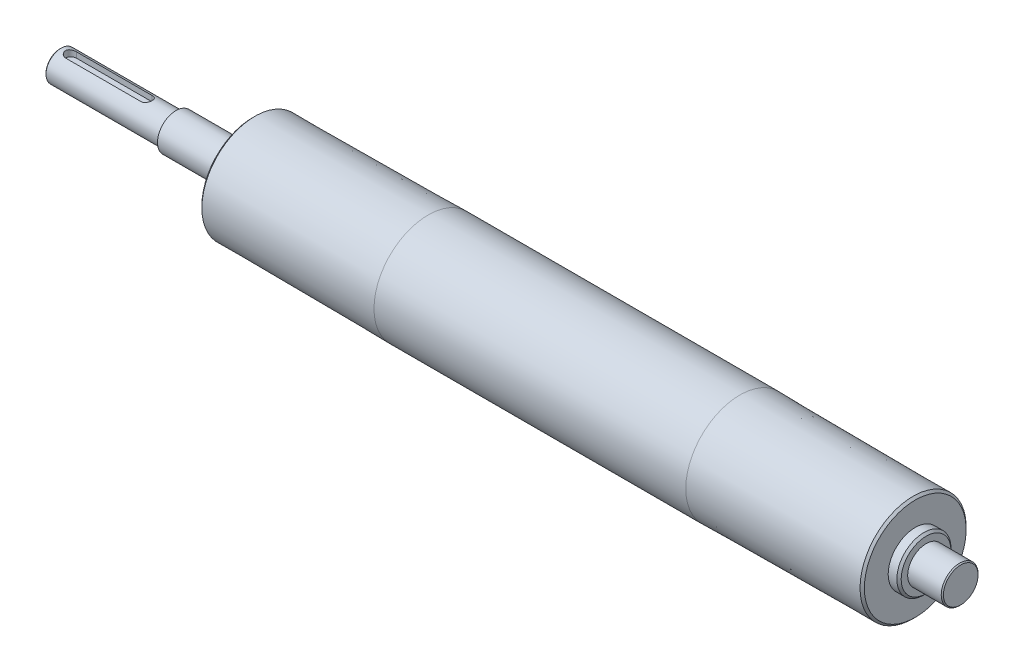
from build123d import *

# Parameters (mm, degrees)
EXTRUDE1_DEPTH = 3


with BuildPart() as part:
    # Sketch2 → Revolve2 (revolve)
    with BuildSketch(Plane(origin=(0, 0, 0), x_dir=(1, 0, 0), z_dir=(0, 1, 0)), mode=Mode.PRIVATE) as revolve2_sk:
        Polygon((-72, 25), (72, 25), (152, 24.5), (153, 23.5), (153, 12.5), (157, 12.5), (158, 11.5), (158, 8.5), (173.5, 8.5), (174, 8), (174, 0), (-226, 0), (-226, 3), (-242, 3), (-242, 6.5), (-241.5, 7), (-188.5, 7), (-188.5, 8.5), (-158, 8.5), (-158, 11.5), (-157, 12.5), (-153, 12.5), (-153, 23.5), (-152, 24.5), align=None)
    revolve(revolve2_sk.sketch.rotate(Axis((-226, 0, 0), (1, 0, 0)), 180), axis=Axis((-226, 0, 0), (1, 0, 0)))

    # Sketch3 → Extrude1 (cut)
    with BuildSketch(Plane(origin=(0, 7, 0), x_dir=(-1, 0, 0), z_dir=(0, 1, 0))):
        with BuildLine():
            Line((202, 2.5), (237, 2.5))
            ThreePointArc((237, 2.5), (239.5, 0), (237, -2.5))
            Line((237, -2.5), (202, -2.5))
            ThreePointArc((202, -2.5), (199.5, 0), (202, 2.5))
        make_face()
    extrude(amount=-EXTRUDE1_DEPTH, mode=Mode.SUBTRACT)


solid = part.part
